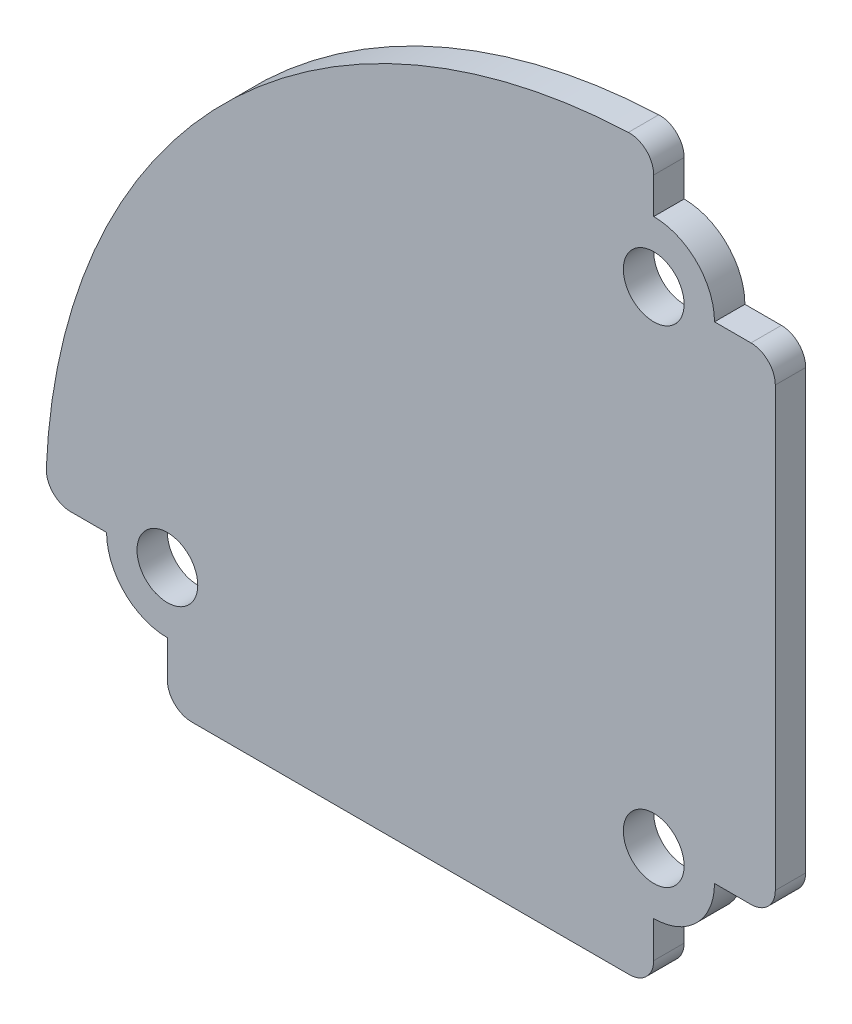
from build123d import *

# Parameters (mm, degrees)
SKETCH1_R           = 3.175
BOSS_EXTRUDE1_DEPTH = 3.175


with BuildPart() as part:
    # Sketch1 → Boss-Extrude1 (new body)
    with BuildSketch(Plane.XY):
        with BuildLine():
            Line((10.16, 50.8), (6.35, 50.8))
            ThreePointArc((6.35, 50.8), (4.490128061, 55.290128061), (0, 57.15))
            Line((0, 57.15), (0, 60.907060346))
            ThreePointArc((0, 60.907060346), (-0.781764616, 62.740147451), (-2.645833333, 63.444854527))
            ThreePointArc((-2.645833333, 63.444854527), (-44.901280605, 44.901280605), (-63.444854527, 2.645833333))
            ThreePointArc((-63.444854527, 2.645833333), (-62.740147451, 0.781764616), (-60.907060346, 0))
            Line((-60.907060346, 0), (-57.15, 0))
            ThreePointArc((-57.15, 0), (-55.290128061, -4.490128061), (-50.8, -6.35))
            Line((-50.8, -6.35), (-50.8, -10.16))
            ThreePointArc((-50.8, -10.16), (-50.056051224, -11.956051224), (-48.26, -12.7))
            Line((-48.26, -12.7), (-2.54, -12.7))
            ThreePointArc((-2.54, -12.7), (-0.743948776, -11.956051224), (0, -10.16))
            Line((0, -10.16), (0, -6.35))
            ThreePointArc((0, -6.35), (4.490128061, -4.490128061), (6.35, 0))
            Line((6.35, 0), (10.16, 0))
            ThreePointArc((10.16, 0), (11.956051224, 0.743948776), (12.7, 2.54))
            Line((12.7, 2.54), (12.7, 48.26))
            ThreePointArc((12.7, 48.26), (11.956051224, 50.056051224), (10.16, 50.8))
        make_face()
        with Locations((0, 50.8)):
            Circle(SKETCH1_R, mode=Mode.SUBTRACT)
        Circle(SKETCH1_R, mode=Mode.SUBTRACT)
        with Locations((-50.8, 0)):
            Circle(SKETCH1_R, mode=Mode.SUBTRACT)
    extrude(amount=BOSS_EXTRUDE1_DEPTH)


solid = part.part
